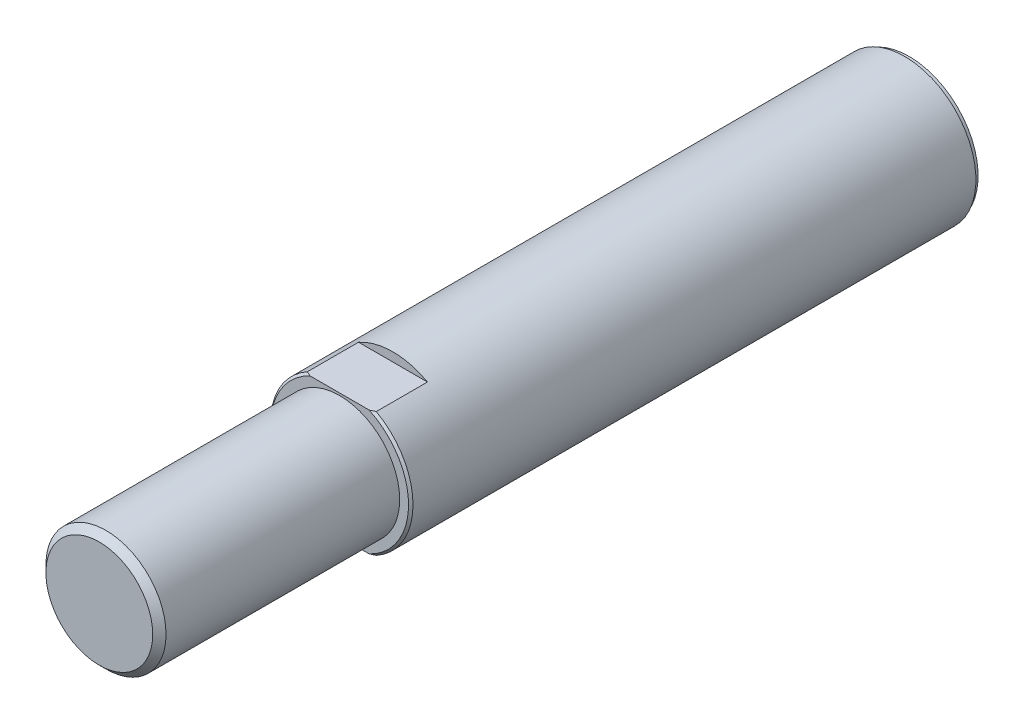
ISO-10303-21;
HEADER;
FILE_DESCRIPTION(('STEP AP214'),'2;1');
FILE_NAME('part.step','',(''),(''),'','','');
FILE_SCHEMA(('AUTOMOTIVE_DESIGN { 1 0 10303 214 1 1 1 1 }'));
ENDSEC;
DATA;
#1=APPLICATION_CONTEXT('core data for automotive mechanical design processes');
#2=APPLICATION_PROTOCOL_DEFINITION('international standard','automotive_design',2000,#1);
#3=PRODUCT_CONTEXT('',#1,'mechanical');
#4=PRODUCT('Part','Part','',(#3));
#5=PRODUCT_RELATED_PRODUCT_CATEGORY('part','',(#4));
#6=PRODUCT_DEFINITION_FORMATION('','',#4);
#7=PRODUCT_DEFINITION_CONTEXT('part definition',#1,'design');
#8=PRODUCT_DEFINITION('design','',#6,#7);
#9=PRODUCT_DEFINITION_SHAPE('','',#8);
#10=(LENGTH_UNIT() NAMED_UNIT(*) SI_UNIT(.MILLI.,.METRE.));
#11=(NAMED_UNIT(*) PLANE_ANGLE_UNIT() SI_UNIT($,.RADIAN.));
#12=(NAMED_UNIT(*) SI_UNIT($,.STERADIAN.) SOLID_ANGLE_UNIT());
#13=UNCERTAINTY_MEASURE_WITH_UNIT(LENGTH_MEASURE(1.E-05),#10,'distance_accuracy_value','');
#14=(GEOMETRIC_REPRESENTATION_CONTEXT(3) GLOBAL_UNCERTAINTY_ASSIGNED_CONTEXT((#13)) GLOBAL_UNIT_ASSIGNED_CONTEXT((#10,
#11,#12)) REPRESENTATION_CONTEXT('',''));
#15=CARTESIAN_POINT('',(0.,0.,0.));
#16=DIRECTION('',(0.,0.,1.));
#17=DIRECTION('',(1.,0.,0.));
#18=AXIS2_PLACEMENT_3D('',#15,#16,#17);
#19=CARTESIAN_POINT('',(0.,0.,182.));
#20=DIRECTION('',(0.,0.,-1.));
#21=DIRECTION('',(-1.,0.,0.));
#22=AXIS2_PLACEMENT_3D('',#19,#20,#21);
#23=CYLINDRICAL_SURFACE('',#22,16.);
#24=CARTESIAN_POINT('',(0.,0.,1.));
#25=DIRECTION('',(0.,0.,-1.));
#26=DIRECTION('',(-1.,0.,0.));
#27=AXIS2_PLACEMENT_3D('',#24,#25,#26);
#28=CIRCLE('',#27,16.);
#29=CARTESIAN_POINT('',(-16.,0.,1.));
#30=VERTEX_POINT('',#29);
#31=EDGE_CURVE('E197',#30,#30,#28,.T.);
#32=ORIENTED_EDGE('',*,*,#31,.F.);
#33=EDGE_LOOP('',(#32));
#34=FACE_BOUND('',#33,.T.);
#35=DIRECTION('',(0.,0.,-1.));
#36=VECTOR('',#35,1.);
#37=CARTESIAN_POINT('',(-7.74596669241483,-14.,182.));
#38=LINE('',#37,#36);
#39=CARTESIAN_POINT('',(-7.74596669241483,-14.,127.5));
#40=VERTEX_POINT('',#39);
#41=CARTESIAN_POINT('',(-7.74596669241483,-14.,116.));
#42=VERTEX_POINT('',#41);
#43=EDGE_CURVE('E209',#40,#42,#38,.T.);
#44=ORIENTED_EDGE('',*,*,#43,.F.);
#45=CARTESIAN_POINT('',(0.,0.,127.5));
#46=DIRECTION('',(0.,0.,1.));
#47=DIRECTION('',(1.,0.,0.));
#48=AXIS2_PLACEMENT_3D('',#45,#46,#47);
#49=CIRCLE('',#48,16.);
#50=CARTESIAN_POINT('',(-7.74596669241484,14.,127.5));
#51=VERTEX_POINT('',#50);
#52=EDGE_CURVE('E129',#40,#51,#49,.F.);
#53=ORIENTED_EDGE('',*,*,#52,.T.);
#54=DIRECTION('',(0.,0.,-1.));
#55=VECTOR('',#54,1.);
#56=CARTESIAN_POINT('',(-7.74596669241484,14.,182.));
#57=LINE('',#56,#55);
#58=CARTESIAN_POINT('',(-7.74596669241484,14.,116.));
#59=VERTEX_POINT('',#58);
#60=EDGE_CURVE('E58',#59,#51,#57,.F.);
#61=ORIENTED_EDGE('',*,*,#60,.F.);
#62=CARTESIAN_POINT('',(0.,0.,116.));
#63=DIRECTION('',(0.,0.,1.));
#64=DIRECTION('',(1.,0.,0.));
#65=AXIS2_PLACEMENT_3D('',#62,#63,#64);
#66=CIRCLE('',#65,16.);
#67=CARTESIAN_POINT('',(7.74596669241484,14.,116.));
#68=VERTEX_POINT('',#67);
#69=EDGE_CURVE('E47',#68,#59,#66,.T.);
#70=ORIENTED_EDGE('',*,*,#69,.F.);
#71=DIRECTION('',(0.,0.,-1.));
#72=VECTOR('',#71,1.);
#73=CARTESIAN_POINT('',(7.74596669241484,14.,182.));
#74=LINE('',#73,#72);
#75=CARTESIAN_POINT('',(7.74596669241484,14.,127.5));
#76=VERTEX_POINT('',#75);
#77=EDGE_CURVE('E214',#76,#68,#74,.T.);
#78=ORIENTED_EDGE('',*,*,#77,.F.);
#79=CARTESIAN_POINT('',(7.74596669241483,-14.,127.5));
#80=VERTEX_POINT('',#79);
#81=EDGE_CURVE('E116',#76,#80,#49,.F.);
#82=ORIENTED_EDGE('',*,*,#81,.T.);
#83=DIRECTION('',(0.,0.,-1.));
#84=VECTOR('',#83,1.);
#85=CARTESIAN_POINT('',(7.74596669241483,-14.,182.));
#86=LINE('',#85,#84);
#87=CARTESIAN_POINT('',(7.74596669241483,-14.,116.));
#88=VERTEX_POINT('',#87);
#89=EDGE_CURVE('E66',#88,#80,#86,.F.);
#90=ORIENTED_EDGE('',*,*,#89,.F.);
#91=EDGE_CURVE('E12',#42,#88,#66,.T.);
#92=ORIENTED_EDGE('',*,*,#91,.F.);
#93=EDGE_LOOP('',(#44,#53,#61,#70,#78,#82,#90,#92));
#94=FACE_BOUND('',#93,.T.);
#95=ADVANCED_FACE('F42',(#34,#94),#23,.T.);
#96=CARTESIAN_POINT('',(0.,0.,128.));
#97=DIRECTION('',(0.,0.,1.));
#98=DIRECTION('',(1.,0.,0.));
#99=AXIS2_PLACEMENT_3D('',#96,#97,#98);
#100=PLANE('',#99);
#101=CARTESIAN_POINT('',(0.,0.,128.));
#102=DIRECTION('',(0.,0.,1.));
#103=DIRECTION('',(1.,0.,0.));
#104=AXIS2_PLACEMENT_3D('',#101,#102,#103);
#105=CIRCLE('',#104,13.5);
#106=CARTESIAN_POINT('',(13.5,0.,128.));
#107=VERTEX_POINT('',#106);
#108=EDGE_CURVE('E192',#107,#107,#105,.T.);
#109=ORIENTED_EDGE('',*,*,#108,.F.);
#110=EDGE_LOOP('',(#109));
#111=FACE_BOUND('',#110,.T.);
#112=CARTESIAN_POINT('',(0.,0.,128.));
#113=DIRECTION('',(0.,0.,1.));
#114=DIRECTION('',(1.,0.,0.));
#115=AXIS2_PLACEMENT_3D('',#112,#113,#114);
#116=CIRCLE('',#115,15.5);
#117=CARTESIAN_POINT('',(-6.65206734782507,14.,128.));
#118=VERTEX_POINT('',#117);
#119=CARTESIAN_POINT('',(-6.65206734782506,-14.,128.));
#120=VERTEX_POINT('',#119);
#121=EDGE_CURVE('E121',#118,#120,#116,.T.);
#122=ORIENTED_EDGE('',*,*,#121,.T.);
#123=DIRECTION('',(1.,0.,0.));
#124=VECTOR('',#123,1.);
#125=CARTESIAN_POINT('',(-24.3713951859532,-14.,128.));
#126=LINE('',#125,#124);
#127=CARTESIAN_POINT('',(6.65206734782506,-14.,128.));
#128=VERTEX_POINT('',#127);
#129=EDGE_CURVE('E108',#120,#128,#126,.T.);
#130=ORIENTED_EDGE('',*,*,#129,.T.);
#131=CARTESIAN_POINT('',(6.65206734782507,14.,128.));
#132=VERTEX_POINT('',#131);
#133=EDGE_CURVE('E114',#128,#132,#116,.T.);
#134=ORIENTED_EDGE('',*,*,#133,.T.);
#135=DIRECTION('',(-1.,0.,0.));
#136=VECTOR('',#135,1.);
#137=CARTESIAN_POINT('',(-24.3713951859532,14.,128.));
#138=LINE('',#137,#136);
#139=EDGE_CURVE('E98',#132,#118,#138,.T.);
#140=ORIENTED_EDGE('',*,*,#139,.T.);
#141=EDGE_LOOP('',(#122,#130,#134,#140));
#142=FACE_BOUND('',#141,.T.);
#143=ADVANCED_FACE('F120',(#111,#142),#100,.T.);
#144=CARTESIAN_POINT('',(0.,0.,128.));
#145=DIRECTION('',(0.,0.,-1.));
#146=DIRECTION('',(-1.,0.,0.));
#147=AXIS2_PLACEMENT_3D('',#144,#145,#146);
#148=CONICAL_SURFACE('',#147,15.5,0.785398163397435);
#149=ORIENTED_EDGE('',*,*,#52,.F.);
#150=CARTESIAN_POINT('',(-32.2989020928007,-14.,108.297456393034));
#151=CARTESIAN_POINT('',(-31.8220166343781,-14.,108.73499334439));
#152=CARTESIAN_POINT('',(-31.3443792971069,-14.,109.171712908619));
#153=CARTESIAN_POINT('',(-30.3873763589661,-14.,110.043261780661));
#154=CARTESIAN_POINT('',(-29.9080107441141,-14.,110.478091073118));
#155=CARTESIAN_POINT('',(-28.9472218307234,-14.,111.345698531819));
#156=CARTESIAN_POINT('',(-28.4657980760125,-14.,111.778476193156));
#157=CARTESIAN_POINT('',(-27.5007345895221,-14.,112.641552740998));
#158=CARTESIAN_POINT('',(-27.0170948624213,-14.,113.071851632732));
#159=CARTESIAN_POINT('',(-26.0441456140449,-14.,113.932354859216));
#160=CARTESIAN_POINT('',(-25.5548196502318,-14.,114.362540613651));
#161=CARTESIAN_POINT('',(-24.5732096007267,-14.,115.21952389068));
#162=CARTESIAN_POINT('',(-24.0809255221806,-14.,115.646321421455));
#163=CARTESIAN_POINT('',(-23.0929844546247,-14.,116.495882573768));
#164=CARTESIAN_POINT('',(-22.5973278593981,-14.,116.918646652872));
#165=CARTESIAN_POINT('',(-21.6020173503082,-14.,117.759444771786));
#166=CARTESIAN_POINT('',(-21.1023634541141,-14.,118.177478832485));
#167=CARTESIAN_POINT('',(-20.1850407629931,-14.,118.936176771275));
#168=CARTESIAN_POINT('',(-19.7681131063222,-14.,119.277736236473));
#169=CARTESIAN_POINT('',(-18.9305653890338,-14.,119.956295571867));
#170=CARTESIAN_POINT('',(-18.5099453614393,-14.,120.293295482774));
#171=CARTESIAN_POINT('',(-17.6643207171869,-14.,120.962005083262));
#172=CARTESIAN_POINT('',(-17.2393148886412,-14.,121.29371324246));
#173=CARTESIAN_POINT('',(-16.3843587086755,-14.,121.950699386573));
#174=CARTESIAN_POINT('',(-15.9544083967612,-14.,122.275977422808));
#175=CARTESIAN_POINT('',(-15.0892607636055,-14.,122.918408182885));
#176=CARTESIAN_POINT('',(-14.6540702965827,-14.,123.235570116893));
#177=CARTESIAN_POINT('',(-13.7769536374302,-14.,123.860506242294));
#178=CARTESIAN_POINT('',(-13.3350271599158,-14.,124.168280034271));
#179=CARTESIAN_POINT('',(-12.4435161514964,-14.,124.772118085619));
#180=CARTESIAN_POINT('',(-11.9939352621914,-14.,125.068187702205));
#181=CARTESIAN_POINT('',(-11.0856378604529,-14.,125.645910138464));
#182=CARTESIAN_POINT('',(-10.6269224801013,-14.,125.927564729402));
#183=CARTESIAN_POINT('',(-9.70452078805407,-14.,126.469435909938));
#184=CARTESIAN_POINT('',(-9.24096523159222,-14.,126.72987376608));
#185=CARTESIAN_POINT('',(-8.30186466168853,-14.,127.228472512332));
#186=CARTESIAN_POINT('',(-7.82631841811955,-14.,127.466631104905));
#187=CARTESIAN_POINT('',(-6.86250658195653,-14.,127.914362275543));
#188=CARTESIAN_POINT('',(-6.37425660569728,-14.,128.123968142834));
#189=CARTESIAN_POINT('',(-5.38383215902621,-14.,128.507418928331));
#190=CARTESIAN_POINT('',(-4.88166173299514,-14.,128.68127411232));
#191=CARTESIAN_POINT('',(-3.96875536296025,-14.,128.953442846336));
#192=CARTESIAN_POINT('',(-3.56047318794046,-14.,129.059939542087));
#193=CARTESIAN_POINT('',(-2.73677808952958,-14.,129.240663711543));
#194=CARTESIAN_POINT('',(-2.32136615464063,-14.,129.31489562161));
#195=CARTESIAN_POINT('',(-1.48675313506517,-14.,129.427330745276));
#196=CARTESIAN_POINT('',(-1.06756511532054,-14.,129.465629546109));
#197=CARTESIAN_POINT('',(-0.227423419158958,-14.,129.504440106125));
#198=CARTESIAN_POINT('',(0.193530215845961,-14.,129.504952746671));
#199=CARTESIAN_POINT('',(1.03378200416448,-14.,129.468162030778));
#200=CARTESIAN_POINT('',(1.45308004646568,-14.,129.430856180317));
#201=CARTESIAN_POINT('',(2.28690266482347,-14.,129.320471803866));
#202=CARTESIAN_POINT('',(2.70142682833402,-14.,129.247390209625));
#203=CARTESIAN_POINT('',(3.52460653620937,-14.,129.068755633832));
#204=CARTESIAN_POINT('',(3.93324113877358,-14.,128.963107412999));
#205=CARTESIAN_POINT('',(4.74209183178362,-14.,128.723731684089));
#206=CARTESIAN_POINT('',(5.14230797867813,-14.,128.590004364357));
#207=CARTESIAN_POINT('',(6.02449004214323,-14.,128.265506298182));
#208=CARTESIAN_POINT('',(6.50421697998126,-14.,128.068684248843));
#209=CARTESIAN_POINT('',(7.45098807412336,-14.,127.646371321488));
#210=CARTESIAN_POINT('',(7.91802592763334,-14.,127.420866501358));
#211=CARTESIAN_POINT('',(8.84123601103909,-14.,126.946743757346));
#212=CARTESIAN_POINT('',(9.29738622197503,-14.,126.698083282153));
#213=CARTESIAN_POINT('',(10.1992303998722,-14.,126.182742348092));
#214=CARTESIAN_POINT('',(10.6449259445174,-14.,125.916064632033));
#215=CARTESIAN_POINT('',(11.5324236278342,-14.,125.36510533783));
#216=CARTESIAN_POINT('',(11.9741209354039,-14.,125.080655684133));
#217=CARTESIAN_POINT('',(12.8496114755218,-14.,124.499861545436));
#218=CARTESIAN_POINT('',(13.283404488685,-14.,124.203516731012));
#219=CARTESIAN_POINT('',(14.1437291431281,-14.,123.601487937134));
#220=CARTESIAN_POINT('',(14.5702682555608,-14.,123.295814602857));
#221=CARTESIAN_POINT('',(15.4175491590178,-14.,122.676521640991));
#222=CARTESIAN_POINT('',(15.83829073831,-14.,122.362901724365));
#223=CARTESIAN_POINT('',(16.6149761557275,-14.,121.774375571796));
#224=CARTESIAN_POINT('',(16.9715845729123,-14.,121.500344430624));
#225=CARTESIAN_POINT('',(17.6815581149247,-14.,120.948109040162));
#226=CARTESIAN_POINT('',(18.0349232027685,-14.,120.669904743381));
#227=CARTESIAN_POINT('',(19.0907539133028,-14.,119.829880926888));
#228=CARTESIAN_POINT('',(19.7889310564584,-14.,119.262668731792));
#229=CARTESIAN_POINT('',(21.1766595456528,-14.,118.116976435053));
#230=CARTESIAN_POINT('',(21.8662053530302,-14.,117.538489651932));
#231=CARTESIAN_POINT('',(23.2380416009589,-14.,116.372970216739));
#232=CARTESIAN_POINT('',(23.9203319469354,-14.,115.785937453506));
#233=CARTESIAN_POINT('',(25.2502856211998,-14.,114.630059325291));
#234=CARTESIAN_POINT('',(25.8981932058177,-14.,114.061494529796));
#235=CARTESIAN_POINT('',(27.1895277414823,-14.,112.919290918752));
#236=CARTESIAN_POINT('',(27.8329546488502,-14.,112.345652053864));
#237=CARTESIAN_POINT('',(29.1152834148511,-14.,111.194897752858));
#238=CARTESIAN_POINT('',(29.7541898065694,-14.,110.617787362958));
#239=CARTESIAN_POINT('',(31.0288022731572,-14.,109.460077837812));
#240=CARTESIAN_POINT('',(31.6645084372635,-14.,108.879478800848));
#241=CARTESIAN_POINT('',(32.2989020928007,-14.,108.297456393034));
#242=B_SPLINE_CURVE_WITH_KNOTS('',3,(#150,#151,#152,#153,#154,#155,#156,#157,#158,#159,#160,
#161,#162,#163,#164,#165,#166,#167,#168,#169,#170,#171,#172,#173,#174,#175,#176,#177,#178,#179,
#180,#181,#182,#183,#184,#185,#186,#187,#188,#189,#190,#191,#192,#193,#194,#195,#196,#197,#198,
#199,#200,#201,#202,#203,#204,#205,#206,#207,#208,#209,#210,#211,#212,#213,#214,#215,#216,#217,
#218,#219,#220,#221,#222,#223,#224,#225,#226,#227,#228,#229,#230,#231,#232,#233,#234,#235,#236,
#237,#238,#239,#240,#241),.UNSPECIFIED.,.F.,.F.,(4,2,2,2,2,2,2,2,2,2,2,2,2,2,2,2,2,2,2,2,2,2,2,
2,2,2,2,2,2,2,2,2,2,2,2,2,2,2,2,2,2,2,2,2,2,4),(0.,1.94157911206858,3.88317396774,
5.82522413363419,7.76727020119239,9.7218661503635,11.6764573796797,13.6308241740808,
15.5851823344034,17.2020736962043,18.8189506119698,20.4362869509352,22.0536103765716,
23.6690088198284,25.2844758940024,26.8991947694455,28.5137147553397,30.1083549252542,
31.7031593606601,33.2960882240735,34.8885590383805,36.153268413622,37.4178038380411,
38.6789657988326,39.9400983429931,41.2013140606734,42.4626379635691,43.7276861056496,
44.9927257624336,46.5471095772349,48.1022518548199,49.660310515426,51.2181325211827,
52.7939918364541,54.3698948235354,55.9440621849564,57.5182868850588,58.8674611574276,
60.2166507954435,62.9151203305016,65.6152408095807,68.3153964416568,70.901376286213,
73.4873813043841,76.0702574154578,78.6530611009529),.UNSPECIFIED.);
#243=EDGE_CURVE('E230',#40,#120,#242,.T.);
#244=ORIENTED_EDGE('',*,*,#243,.T.);
#245=ORIENTED_EDGE('',*,*,#121,.F.);
#246=CARTESIAN_POINT('',(32.2989020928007,14.,108.297456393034));
#247=CARTESIAN_POINT('',(31.8220166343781,14.,108.73499334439));
#248=CARTESIAN_POINT('',(31.3443792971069,14.,109.171712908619));
#249=CARTESIAN_POINT('',(30.3873763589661,14.,110.043261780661));
#250=CARTESIAN_POINT('',(29.9080107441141,14.,110.478091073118));
#251=CARTESIAN_POINT('',(28.9472218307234,14.,111.345698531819));
#252=CARTESIAN_POINT('',(28.4657980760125,14.,111.778476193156));
#253=CARTESIAN_POINT('',(27.5007345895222,14.,112.641552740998));
#254=CARTESIAN_POINT('',(27.0170948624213,14.,113.071851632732));
#255=CARTESIAN_POINT('',(26.0441456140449,14.,113.932354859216));
#256=CARTESIAN_POINT('',(25.5548196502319,14.,114.362540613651));
#257=CARTESIAN_POINT('',(24.5732096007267,14.,115.21952389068));
#258=CARTESIAN_POINT('',(24.0809255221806,14.,115.646321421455));
#259=CARTESIAN_POINT('',(23.0929844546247,14.,116.495882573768));
#260=CARTESIAN_POINT('',(22.5973278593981,14.,116.918646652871));
#261=CARTESIAN_POINT('',(21.6020173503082,14.,117.759444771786));
#262=CARTESIAN_POINT('',(21.1023634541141,14.,118.177478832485));
#263=CARTESIAN_POINT('',(20.1850407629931,14.,118.936176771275));
#264=CARTESIAN_POINT('',(19.7681131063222,14.,119.277736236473));
#265=CARTESIAN_POINT('',(18.9305653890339,14.,119.956295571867));
#266=CARTESIAN_POINT('',(18.5099453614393,14.,120.293295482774));
#267=CARTESIAN_POINT('',(17.6643207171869,14.,120.962005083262));
#268=CARTESIAN_POINT('',(17.2393148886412,14.,121.29371324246));
#269=CARTESIAN_POINT('',(16.3843587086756,14.,121.950699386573));
#270=CARTESIAN_POINT('',(15.9544083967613,14.,122.275977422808));
#271=CARTESIAN_POINT('',(15.0892607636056,14.,122.918408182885));
#272=CARTESIAN_POINT('',(14.6540702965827,14.,123.235570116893));
#273=CARTESIAN_POINT('',(13.7769536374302,14.,123.860506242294));
#274=CARTESIAN_POINT('',(13.3350271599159,14.,124.168280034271));
#275=CARTESIAN_POINT('',(12.4435161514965,14.,124.772118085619));
#276=CARTESIAN_POINT('',(11.9939352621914,14.,125.068187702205));
#277=CARTESIAN_POINT('',(11.085637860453,14.,125.645910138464));
#278=CARTESIAN_POINT('',(10.6269224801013,14.,125.927564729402));
#279=CARTESIAN_POINT('',(9.70452078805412,14.,126.469435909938));
#280=CARTESIAN_POINT('',(9.24096523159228,14.,126.72987376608));
#281=CARTESIAN_POINT('',(8.30186466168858,14.,127.228472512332));
#282=CARTESIAN_POINT('',(7.8263184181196,14.,127.466631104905));
#283=CARTESIAN_POINT('',(6.86250658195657,14.,127.914362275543));
#284=CARTESIAN_POINT('',(6.37425660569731,14.,128.123968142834));
#285=CARTESIAN_POINT('',(5.38383215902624,14.,128.50741892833));
#286=CARTESIAN_POINT('',(4.88166173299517,14.,128.68127411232));
#287=CARTESIAN_POINT('',(3.96875536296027,14.,128.953442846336));
#288=CARTESIAN_POINT('',(3.56047318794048,14.,129.059939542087));
#289=CARTESIAN_POINT('',(2.73677808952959,14.,129.240663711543));
#290=CARTESIAN_POINT('',(2.32136615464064,14.,129.31489562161));
#291=CARTESIAN_POINT('',(1.48675313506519,14.,129.427330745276));
#292=CARTESIAN_POINT('',(1.06756511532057,14.,129.465629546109));
#293=CARTESIAN_POINT('',(0.227423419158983,14.,129.504440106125));
#294=CARTESIAN_POINT('',(-0.193530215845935,14.,129.504952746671));
#295=CARTESIAN_POINT('',(-1.03378200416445,14.,129.468162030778));
#296=CARTESIAN_POINT('',(-1.45308004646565,14.,129.430856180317));
#297=CARTESIAN_POINT('',(-2.28690266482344,14.,129.320471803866));
#298=CARTESIAN_POINT('',(-2.70142682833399,14.,129.247390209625));
#299=CARTESIAN_POINT('',(-3.52460653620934,14.,129.068755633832));
#300=CARTESIAN_POINT('',(-3.93324113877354,14.,128.963107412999));
#301=CARTESIAN_POINT('',(-4.74209183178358,14.,128.723731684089));
#302=CARTESIAN_POINT('',(-5.1423079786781,14.,128.590004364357));
#303=CARTESIAN_POINT('',(-6.0244900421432,14.,128.265506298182));
#304=CARTESIAN_POINT('',(-6.50421697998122,14.,128.068684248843));
#305=CARTESIAN_POINT('',(-7.45098807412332,14.,127.646371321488));
#306=CARTESIAN_POINT('',(-7.9180259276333,14.,127.420866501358));
#307=CARTESIAN_POINT('',(-8.84123601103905,14.,126.946743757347));
#308=CARTESIAN_POINT('',(-9.29738622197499,14.,126.698083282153));
#309=CARTESIAN_POINT('',(-10.1992303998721,14.,126.182742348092));
#310=CARTESIAN_POINT('',(-10.6449259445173,14.,125.916064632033));
#311=CARTESIAN_POINT('',(-11.5324236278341,14.,125.36510533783));
#312=CARTESIAN_POINT('',(-11.9741209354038,14.,125.080655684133));
#313=CARTESIAN_POINT('',(-12.8496114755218,14.,124.499861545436));
#314=CARTESIAN_POINT('',(-13.283404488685,14.,124.203516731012));
#315=CARTESIAN_POINT('',(-14.143729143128,14.,123.601487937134));
#316=CARTESIAN_POINT('',(-14.5702682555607,14.,123.295814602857));
#317=CARTESIAN_POINT('',(-15.4175491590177,14.,122.676521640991));
#318=CARTESIAN_POINT('',(-15.83829073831,14.,122.362901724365));
#319=CARTESIAN_POINT('',(-16.6149761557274,14.,121.774375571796));
#320=CARTESIAN_POINT('',(-16.9715845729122,14.,121.500344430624));
#321=CARTESIAN_POINT('',(-17.6815581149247,14.,120.948109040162));
#322=CARTESIAN_POINT('',(-18.0349232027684,14.,120.669904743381));
#323=CARTESIAN_POINT('',(-19.0907539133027,14.,119.829880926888));
#324=CARTESIAN_POINT('',(-19.7889310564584,14.,119.262668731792));
#325=CARTESIAN_POINT('',(-21.1766595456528,14.,118.116976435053));
#326=CARTESIAN_POINT('',(-21.8662053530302,14.,117.538489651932));
#327=CARTESIAN_POINT('',(-23.2380416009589,14.,116.372970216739));
#328=CARTESIAN_POINT('',(-23.9203319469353,14.,115.785937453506));
#329=CARTESIAN_POINT('',(-25.2502856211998,14.,114.630059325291));
#330=CARTESIAN_POINT('',(-25.8981932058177,14.,114.061494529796));
#331=CARTESIAN_POINT('',(-27.1895277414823,14.,112.919290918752));
#332=CARTESIAN_POINT('',(-27.8329546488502,14.,112.345652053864));
#333=CARTESIAN_POINT('',(-29.1152834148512,14.,111.194897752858));
#334=CARTESIAN_POINT('',(-29.7541898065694,14.,110.617787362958));
#335=CARTESIAN_POINT('',(-31.0288022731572,14.,109.460077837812));
#336=CARTESIAN_POINT('',(-31.6645084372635,14.,108.879478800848));
#337=CARTESIAN_POINT('',(-32.2989020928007,14.,108.297456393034));
#338=B_SPLINE_CURVE_WITH_KNOTS('',3,(#246,#247,#248,#249,#250,#251,#252,#253,#254,#255,#256,
#257,#258,#259,#260,#261,#262,#263,#264,#265,#266,#267,#268,#269,#270,#271,#272,#273,#274,#275,
#276,#277,#278,#279,#280,#281,#282,#283,#284,#285,#286,#287,#288,#289,#290,#291,#292,#293,#294,
#295,#296,#297,#298,#299,#300,#301,#302,#303,#304,#305,#306,#307,#308,#309,#310,#311,#312,#313,
#314,#315,#316,#317,#318,#319,#320,#321,#322,#323,#324,#325,#326,#327,#328,#329,#330,#331,#332,
#333,#334,#335,#336,#337),.UNSPECIFIED.,.F.,.F.,(4,2,2,2,2,2,2,2,2,2,2,2,2,2,2,2,2,2,2,2,2,2,2,
2,2,2,2,2,2,2,2,2,2,2,2,2,2,2,2,2,2,2,2,2,2,4),(0.,1.94157911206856,3.88317396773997,
5.82522413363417,7.76727020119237,9.72186615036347,11.6764573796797,13.6308241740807,
15.5851823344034,17.2020736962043,18.8189506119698,20.4362869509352,22.0536103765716,
23.6690088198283,25.2844758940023,26.8991947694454,28.5137147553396,30.1083549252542,
31.7031593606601,33.2960882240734,34.8885590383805,36.153268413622,37.4178038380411,
38.6789657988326,39.9400983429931,41.2013140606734,42.462637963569,43.7276861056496,
44.9927257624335,46.5471095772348,48.1022518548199,49.660310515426,51.2181325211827,
52.7939918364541,54.3698948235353,55.9440621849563,57.5182868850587,58.8674611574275,
60.2166507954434,62.9151203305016,65.6152408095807,68.3153964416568,70.901376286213,
73.4873813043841,76.0702574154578,78.653061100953),.UNSPECIFIED.);
#339=EDGE_CURVE('E103',#118,#51,#338,.T.);
#340=ORIENTED_EDGE('',*,*,#339,.T.);
#341=EDGE_LOOP('',(#149,#244,#245,#340));
#342=FACE_BOUND('',#341,.T.);
#343=ADVANCED_FACE('F44',(#342),#148,.T.);
#344=ORIENTED_EDGE('',*,*,#133,.F.);
#345=EDGE_CURVE('E117',#128,#80,#242,.T.);
#346=ORIENTED_EDGE('',*,*,#345,.T.);
#347=ORIENTED_EDGE('',*,*,#81,.F.);
#348=EDGE_CURVE('E101',#76,#132,#338,.T.);
#349=ORIENTED_EDGE('',*,*,#348,.T.);
#350=EDGE_LOOP('',(#344,#346,#347,#349));
#351=FACE_BOUND('',#350,.T.);
#352=ADVANCED_FACE('F113',(#351),#148,.T.);
#353=CARTESIAN_POINT('',(0.,0.,128.));
#354=DIRECTION('',(0.,0.,1.));
#355=DIRECTION('',(1.,0.,0.));
#356=AXIS2_PLACEMENT_3D('',#353,#354,#355);
#357=CYLINDRICAL_SURFACE('',#356,13.5);
#358=CARTESIAN_POINT('',(0.,0.,180.5));
#359=DIRECTION('',(0.,0.,1.));
#360=DIRECTION('',(1.,0.,0.));
#361=AXIS2_PLACEMENT_3D('',#358,#359,#360);
#362=CIRCLE('',#361,13.5);
#363=CARTESIAN_POINT('',(13.5,0.,180.5));
#364=VERTEX_POINT('',#363);
#365=EDGE_CURVE('E122',#364,#364,#362,.F.);
#366=ORIENTED_EDGE('',*,*,#365,.T.);
#367=EDGE_LOOP('',(#366));
#368=FACE_BOUND('',#367,.T.);
#369=ORIENTED_EDGE('',*,*,#108,.T.);
#370=EDGE_LOOP('',(#369));
#371=FACE_BOUND('',#370,.T.);
#372=ADVANCED_FACE('F169',(#368,#371),#357,.T.);
#373=CARTESIAN_POINT('',(0.,0.,182.));
#374=DIRECTION('',(0.,0.,1.));
#375=DIRECTION('',(1.,0.,0.));
#376=AXIS2_PLACEMENT_3D('',#373,#374,#375);
#377=PLANE('',#376);
#378=CARTESIAN_POINT('',(0.,0.,182.));
#379=DIRECTION('',(0.,0.,1.));
#380=DIRECTION('',(1.,0.,0.));
#381=AXIS2_PLACEMENT_3D('',#378,#379,#380);
#382=CIRCLE('',#381,12.);
#383=CARTESIAN_POINT('',(12.,0.,182.));
#384=VERTEX_POINT('',#383);
#385=EDGE_CURVE('E125',#384,#384,#382,.T.);
#386=ORIENTED_EDGE('',*,*,#385,.T.);
#387=EDGE_LOOP('',(#386));
#388=FACE_BOUND('',#387,.T.);
#389=ADVANCED_FACE('F159',(#388),#377,.T.);
#390=CARTESIAN_POINT('',(0.,0.,1.));
#391=DIRECTION('',(0.,0.,-1.));
#392=DIRECTION('',(-1.,0.,0.));
#393=AXIS2_PLACEMENT_3D('',#390,#391,#392);
#394=PLANE('',#393);
#395=CARTESIAN_POINT('',(0.,0.,1.));
#396=DIRECTION('',(0.,0.,-1.));
#397=DIRECTION('',(-1.,0.,0.));
#398=AXIS2_PLACEMENT_3D('',#395,#396,#397);
#399=CIRCLE('',#398,15.5);
#400=CARTESIAN_POINT('',(-15.5,0.,1.));
#401=VERTEX_POINT('',#400);
#402=EDGE_CURVE('E200',#401,#401,#399,.T.);
#403=ORIENTED_EDGE('',*,*,#402,.F.);
#404=EDGE_LOOP('',(#403));
#405=FACE_BOUND('',#404,.T.);
#406=ORIENTED_EDGE('',*,*,#31,.T.);
#407=EDGE_LOOP('',(#406));
#408=FACE_BOUND('',#407,.T.);
#409=ADVANCED_FACE('F155',(#405,#408),#394,.T.);
#410=CARTESIAN_POINT('',(0.,0.,1.));
#411=DIRECTION('',(0.,0.,-1.));
#412=DIRECTION('',(-1.,0.,0.));
#413=AXIS2_PLACEMENT_3D('',#410,#411,#412);
#414=CYLINDRICAL_SURFACE('',#413,15.5);
#415=ORIENTED_EDGE('',*,*,#402,.T.);
#416=EDGE_LOOP('',(#415));
#417=FACE_BOUND('',#416,.T.);
#418=CARTESIAN_POINT('',(0.,0.,0.));
#419=DIRECTION('',(0.,0.,-1.));
#420=DIRECTION('',(-1.,0.,0.));
#421=AXIS2_PLACEMENT_3D('',#418,#419,#420);
#422=CIRCLE('',#421,15.5);
#423=CARTESIAN_POINT('',(-15.5,0.,0.));
#424=VERTEX_POINT('',#423);
#425=EDGE_CURVE('E206',#424,#424,#422,.T.);
#426=ORIENTED_EDGE('',*,*,#425,.F.);
#427=EDGE_LOOP('',(#426));
#428=FACE_BOUND('',#427,.T.);
#429=ADVANCED_FACE('F151',(#417,#428),#414,.T.);
#430=CARTESIAN_POINT('',(0.,0.,50.));
#431=DIRECTION('',(0.,0.,-1.));
#432=DIRECTION('',(-1.,0.,0.));
#433=AXIS2_PLACEMENT_3D('',#430,#431,#432);
#434=CONICAL_SURFACE('',#433,5.99999999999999,1.02974425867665);
#435=CARTESIAN_POINT('',(0.,0.,53.6051637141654));
#436=VERTEX_POINT('',#435);
#437=VERTEX_LOOP('',#436);
#438=FACE_BOUND('',#437,.T.);
#439=CARTESIAN_POINT('',(0.,0.,50.));
#440=DIRECTION('',(0.,0.,-1.));
#441=DIRECTION('',(-1.,0.,0.));
#442=AXIS2_PLACEMENT_3D('',#439,#440,#441);
#443=CIRCLE('',#442,5.99999999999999);
#444=CARTESIAN_POINT('',(-5.99999999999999,0.,50.));
#445=VERTEX_POINT('',#444);
#446=EDGE_CURVE('E194',#445,#445,#443,.T.);
#447=ORIENTED_EDGE('',*,*,#446,.T.);
#448=EDGE_LOOP('',(#447));
#449=FACE_BOUND('',#448,.T.);
#450=ADVANCED_FACE('F154',(#438,#449),#434,.F.);
#451=CARTESIAN_POINT('',(0.,0.,0.));
#452=DIRECTION('',(0.,0.,-1.));
#453=DIRECTION('',(-1.,0.,0.));
#454=AXIS2_PLACEMENT_3D('',#451,#452,#453);
#455=CYLINDRICAL_SURFACE('',#454,5.99999999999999);
#456=ORIENTED_EDGE('',*,*,#446,.F.);
#457=EDGE_LOOP('',(#456));
#458=FACE_BOUND('',#457,.T.);
#459=CARTESIAN_POINT('',(0.,0.,0.));
#460=DIRECTION('',(0.,0.,-1.));
#461=DIRECTION('',(-1.,0.,0.));
#462=AXIS2_PLACEMENT_3D('',#459,#460,#461);
#463=CIRCLE('',#462,5.99999999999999);
#464=CARTESIAN_POINT('',(-5.99999999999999,0.,0.));
#465=VERTEX_POINT('',#464);
#466=EDGE_CURVE('E199',#465,#465,#463,.T.);
#467=ORIENTED_EDGE('',*,*,#466,.T.);
#468=EDGE_LOOP('',(#467));
#469=FACE_BOUND('',#468,.T.);
#470=ADVANCED_FACE('F161',(#458,#469),#455,.F.);
#471=CARTESIAN_POINT('',(0.,0.,0.));
#472=DIRECTION('',(0.,0.,1.));
#473=DIRECTION('',(1.,0.,0.));
#474=AXIS2_PLACEMENT_3D('',#471,#472,#473);
#475=PLANE('',#474);
#476=ORIENTED_EDGE('',*,*,#466,.F.);
#477=EDGE_LOOP('',(#476));
#478=FACE_BOUND('',#477,.T.);
#479=ORIENTED_EDGE('',*,*,#425,.T.);
#480=EDGE_LOOP('',(#479));
#481=FACE_BOUND('',#480,.T.);
#482=ADVANCED_FACE('F164',(#478,#481),#475,.F.);
#483=CARTESIAN_POINT('',(0.,0.,182.));
#484=DIRECTION('',(0.,0.,-1.));
#485=DIRECTION('',(-1.,0.,0.));
#486=AXIS2_PLACEMENT_3D('',#483,#484,#485);
#487=CONICAL_SURFACE('',#486,12.,0.785398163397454);
#488=ORIENTED_EDGE('',*,*,#365,.F.);
#489=EDGE_LOOP('',(#488));
#490=FACE_BOUND('',#489,.T.);
#491=ORIENTED_EDGE('',*,*,#385,.F.);
#492=EDGE_LOOP('',(#491));
#493=FACE_BOUND('',#492,.T.);
#494=ADVANCED_FACE('F144',(#490,#493),#487,.T.);
#495=CARTESIAN_POINT('',(-24.3713951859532,14.,116.));
#496=DIRECTION('',(0.,1.,0.));
#497=DIRECTION('',(0.,0.,1.));
#498=AXIS2_PLACEMENT_3D('',#495,#496,#497);
#499=PLANE('',#498);
#500=ORIENTED_EDGE('',*,*,#77,.T.);
#501=DIRECTION('',(-1.,0.,0.));
#502=VECTOR('',#501,1.);
#503=CARTESIAN_POINT('',(-24.3713951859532,14.,116.));
#504=LINE('',#503,#502);
#505=EDGE_CURVE('E218',#68,#59,#504,.T.);
#506=ORIENTED_EDGE('',*,*,#505,.T.);
#507=ORIENTED_EDGE('',*,*,#60,.T.);
#508=ORIENTED_EDGE('',*,*,#339,.F.);
#509=ORIENTED_EDGE('',*,*,#139,.F.);
#510=ORIENTED_EDGE('',*,*,#348,.F.);
#511=EDGE_LOOP('',(#500,#506,#507,#508,#509,#510));
#512=FACE_BOUND('',#511,.T.);
#513=ADVANCED_FACE('F100',(#512),#499,.T.);
#514=CARTESIAN_POINT('',(0.,0.,116.));
#515=DIRECTION('',(0.,0.,1.));
#516=DIRECTION('',(1.,0.,0.));
#517=AXIS2_PLACEMENT_3D('',#514,#515,#516);
#518=PLANE('',#517);
#519=ORIENTED_EDGE('',*,*,#69,.T.);
#520=ORIENTED_EDGE('',*,*,#505,.F.);
#521=EDGE_LOOP('',(#519,#520));
#522=FACE_BOUND('',#521,.T.);
#523=ADVANCED_FACE('F143',(#522),#518,.T.);
#524=ORIENTED_EDGE('',*,*,#91,.T.);
#525=DIRECTION('',(1.,0.,0.));
#526=VECTOR('',#525,1.);
#527=CARTESIAN_POINT('',(-24.3713951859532,-14.,116.));
#528=LINE('',#527,#526);
#529=EDGE_CURVE('E217',#42,#88,#528,.T.);
#530=ORIENTED_EDGE('',*,*,#529,.F.);
#531=EDGE_LOOP('',(#524,#530));
#532=FACE_BOUND('',#531,.T.);
#533=ADVANCED_FACE('F149',(#532),#518,.T.);
#534=CARTESIAN_POINT('',(-24.3713951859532,-14.,116.));
#535=DIRECTION('',(0.,-1.,0.));
#536=DIRECTION('',(0.,0.,-1.));
#537=AXIS2_PLACEMENT_3D('',#534,#535,#536);
#538=PLANE('',#537);
#539=ORIENTED_EDGE('',*,*,#43,.T.);
#540=ORIENTED_EDGE('',*,*,#529,.T.);
#541=ORIENTED_EDGE('',*,*,#89,.T.);
#542=ORIENTED_EDGE('',*,*,#345,.F.);
#543=ORIENTED_EDGE('',*,*,#129,.F.);
#544=ORIENTED_EDGE('',*,*,#243,.F.);
#545=EDGE_LOOP('',(#539,#540,#541,#542,#543,#544));
#546=FACE_BOUND('',#545,.T.);
#547=ADVANCED_FACE('F145',(#546),#538,.T.);
#548=CLOSED_SHELL('',(#95,#143,#343,#352,#372,#389,#409,#429,#450,#470,#482,#494,#513,#523,#533,#547));
#549=MANIFOLD_SOLID_BREP('B2',#548);
#550=ADVANCED_BREP_SHAPE_REPRESENTATION('',(#18,#549),#14);
#551=SHAPE_DEFINITION_REPRESENTATION(#9,#550);
ENDSEC;
END-ISO-10303-21;
